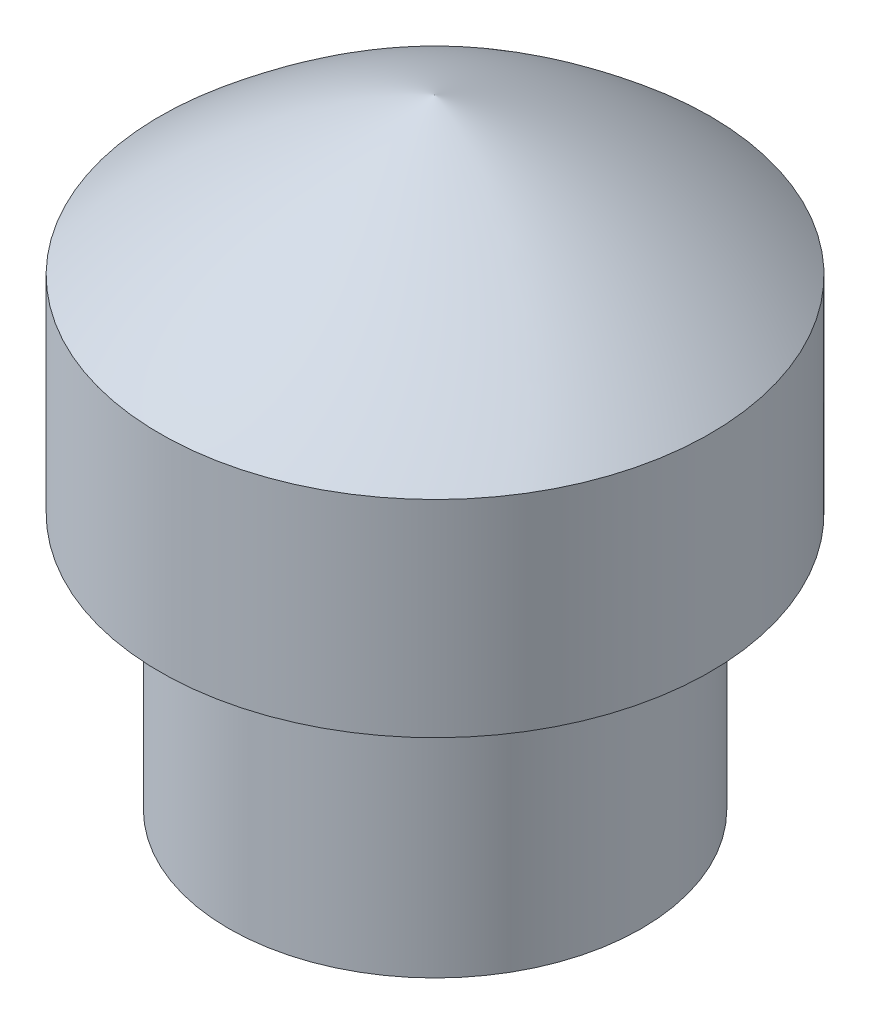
from build123d import *

# Parameters (mm, degrees)
SKETCH2_R          = 1.5
CUT_EXTRUDE1_DEPTH = 7


with BuildPart() as part:
    # Sketch1 → Revolve1 (revolve)
    with BuildSketch(Plane.XY, mode=Mode.PRIVATE) as revolve1_sk:
        with BuildLine():
            Line((0, 0), (6, 0))
            Line((6, 0), (6, 7.466666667))
            Line((6, 7.466666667), (8, 7.466666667))
            Line((8, 7.466666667), (8, 13.466666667))
            ThreePointArc((8, 13.466666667), (4.210216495, 16.104303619), (0, 18))
            Line((0, 18), (0, 0))
        make_face()
    revolve(revolve1_sk.sketch.rotate(Axis((0, 0, 0), (0, 1, 0)), 90), axis=Axis((0, 0, 0), (0, 1, 0)))

    # Sketch2 → Cut-Extrude1 (cut)
    with BuildSketch(Plane.XZ):
        with Locations(Location((0, 0, 0), (0, 0, 270))):
            Circle(SKETCH2_R)
    extrude(amount=-CUT_EXTRUDE1_DEPTH, mode=Mode.SUBTRACT)


solid = part.part
